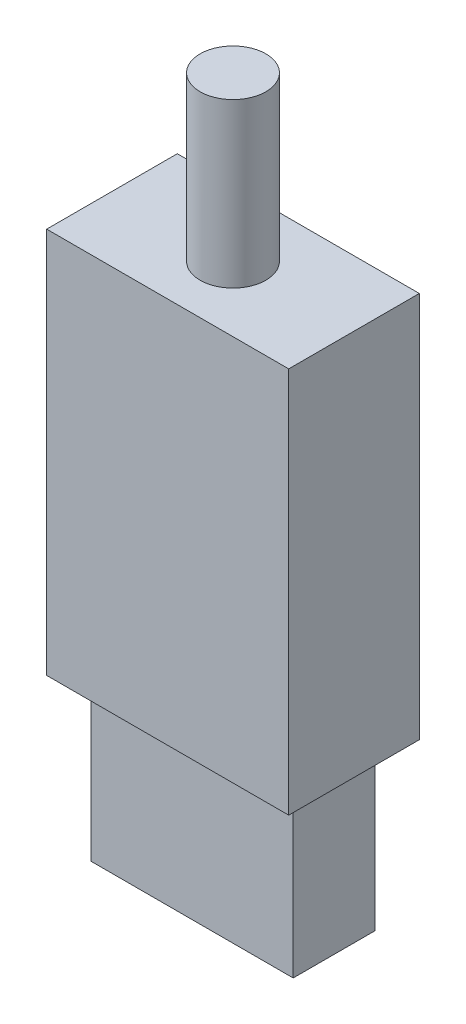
ISO-10303-21;
HEADER;
FILE_DESCRIPTION(('STEP AP214'),'2;1');
FILE_NAME('part.step','',(''),(''),'','','');
FILE_SCHEMA(('AUTOMOTIVE_DESIGN { 1 0 10303 214 1 1 1 1 }'));
ENDSEC;
DATA;
#1=APPLICATION_CONTEXT('core data for automotive mechanical design processes');
#2=APPLICATION_PROTOCOL_DEFINITION('international standard','automotive_design',2000,#1);
#3=PRODUCT_CONTEXT('',#1,'mechanical');
#4=PRODUCT('Part','Part','',(#3));
#5=PRODUCT_RELATED_PRODUCT_CATEGORY('part','',(#4));
#6=PRODUCT_DEFINITION_FORMATION('','',#4);
#7=PRODUCT_DEFINITION_CONTEXT('part definition',#1,'design');
#8=PRODUCT_DEFINITION('design','',#6,#7);
#9=PRODUCT_DEFINITION_SHAPE('','',#8);
#10=(LENGTH_UNIT() NAMED_UNIT(*) SI_UNIT(.MILLI.,.METRE.));
#11=(NAMED_UNIT(*) PLANE_ANGLE_UNIT() SI_UNIT($,.RADIAN.));
#12=(NAMED_UNIT(*) SI_UNIT($,.STERADIAN.) SOLID_ANGLE_UNIT());
#13=UNCERTAINTY_MEASURE_WITH_UNIT(LENGTH_MEASURE(1.E-05),#10,'distance_accuracy_value','');
#14=(GEOMETRIC_REPRESENTATION_CONTEXT(3) GLOBAL_UNCERTAINTY_ASSIGNED_CONTEXT((#13)) GLOBAL_UNIT_ASSIGNED_CONTEXT((#10,
#11,#12)) REPRESENTATION_CONTEXT('',''));
#15=CARTESIAN_POINT('',(0.,0.,0.));
#16=DIRECTION('',(0.,0.,1.));
#17=DIRECTION('',(1.,0.,0.));
#18=AXIS2_PLACEMENT_3D('',#15,#16,#17);
#19=CARTESIAN_POINT('',(0.,10.16,0.));
#20=DIRECTION('',(1.,0.,0.));
#21=DIRECTION('',(0.,0.,-1.));
#22=AXIS2_PLACEMENT_3D('',#19,#20,#21);
#23=PLANE('',#22);
#24=DIRECTION('',(0.,0.,1.));
#25=VECTOR('',#24,1.);
#26=CARTESIAN_POINT('',(0.,0.,0.));
#27=LINE('',#26,#25);
#28=CARTESIAN_POINT('',(0.,0.,-5.07999999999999));
#29=VERTEX_POINT('',#28);
#30=CARTESIAN_POINT('',(0.,0.,0.));
#31=VERTEX_POINT('',#30);
#32=EDGE_CURVE('E132',#29,#31,#27,.T.);
#33=ORIENTED_EDGE('',*,*,#32,.T.);
#34=DIRECTION('',(0.,-1.,0.));
#35=VECTOR('',#34,1.);
#36=CARTESIAN_POINT('',(0.,10.16,0.));
#37=LINE('',#36,#35);
#38=CARTESIAN_POINT('',(0.,10.16,0.));
#39=VERTEX_POINT('',#38);
#40=EDGE_CURVE('E41',#39,#31,#37,.T.);
#41=ORIENTED_EDGE('',*,*,#40,.F.);
#42=DIRECTION('',(0.,0.,1.));
#43=VECTOR('',#42,1.);
#44=CARTESIAN_POINT('',(0.,10.16,0.));
#45=LINE('',#44,#43);
#46=CARTESIAN_POINT('',(0.,10.16,-5.07999999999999));
#47=VERTEX_POINT('',#46);
#48=EDGE_CURVE('E141',#47,#39,#45,.T.);
#49=ORIENTED_EDGE('',*,*,#48,.F.);
#50=DIRECTION('',(0.,-1.,0.));
#51=VECTOR('',#50,1.);
#52=CARTESIAN_POINT('',(0.,10.16,-5.07999999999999));
#53=LINE('',#52,#51);
#54=EDGE_CURVE('E150',#47,#29,#53,.T.);
#55=ORIENTED_EDGE('',*,*,#54,.T.);
#56=EDGE_LOOP('',(#33,#41,#49,#55));
#57=FACE_BOUND('',#56,.T.);
#58=ADVANCED_FACE('F33',(#57),#23,.F.);
#59=CARTESIAN_POINT('',(0.,10.16,0.));
#60=DIRECTION('',(0.,0.,-1.));
#61=DIRECTION('',(-1.,0.,0.));
#62=AXIS2_PLACEMENT_3D('',#59,#60,#61);
#63=PLANE('',#62);
#64=DIRECTION('',(1.,0.,0.));
#65=VECTOR('',#64,1.);
#66=CARTESIAN_POINT('',(0.,0.,0.));
#67=LINE('',#66,#65);
#68=CARTESIAN_POINT('',(12.573,0.,0.));
#69=VERTEX_POINT('',#68);
#70=EDGE_CURVE('E135',#31,#69,#67,.T.);
#71=ORIENTED_EDGE('',*,*,#70,.T.);
#72=DIRECTION('',(0.,-1.,0.));
#73=VECTOR('',#72,1.);
#74=CARTESIAN_POINT('',(12.573,10.16,0.));
#75=LINE('',#74,#73);
#76=CARTESIAN_POINT('',(12.573,10.16,0.));
#77=VERTEX_POINT('',#76);
#78=EDGE_CURVE('E157',#77,#69,#75,.T.);
#79=ORIENTED_EDGE('',*,*,#78,.F.);
#80=DIRECTION('',(1.,0.,0.));
#81=VECTOR('',#80,1.);
#82=CARTESIAN_POINT('',(0.,10.16,0.));
#83=LINE('',#82,#81);
#84=EDGE_CURVE('E76',#39,#77,#83,.T.);
#85=ORIENTED_EDGE('',*,*,#84,.F.);
#86=ORIENTED_EDGE('',*,*,#40,.T.);
#87=EDGE_LOOP('',(#71,#79,#85,#86));
#88=FACE_BOUND('',#87,.T.);
#89=ADVANCED_FACE('F158',(#88),#63,.F.);
#90=CARTESIAN_POINT('',(12.573,10.16,0.));
#91=DIRECTION('',(-1.,0.,0.));
#92=DIRECTION('',(0.,0.,1.));
#93=AXIS2_PLACEMENT_3D('',#90,#91,#92);
#94=PLANE('',#93);
#95=DIRECTION('',(0.,0.,-1.));
#96=VECTOR('',#95,1.);
#97=CARTESIAN_POINT('',(12.573,0.,0.));
#98=LINE('',#97,#96);
#99=CARTESIAN_POINT('',(12.573,0.,-5.07999999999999));
#100=VERTEX_POINT('',#99);
#101=EDGE_CURVE('E65',#69,#100,#98,.T.);
#102=ORIENTED_EDGE('',*,*,#101,.T.);
#103=DIRECTION('',(0.,-1.,0.));
#104=VECTOR('',#103,1.);
#105=CARTESIAN_POINT('',(12.573,10.16,-5.07999999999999));
#106=LINE('',#105,#104);
#107=CARTESIAN_POINT('',(12.573,10.16,-5.07999999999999));
#108=VERTEX_POINT('',#107);
#109=EDGE_CURVE('E49',#108,#100,#106,.T.);
#110=ORIENTED_EDGE('',*,*,#109,.F.);
#111=DIRECTION('',(0.,0.,-1.));
#112=VECTOR('',#111,1.);
#113=CARTESIAN_POINT('',(12.573,10.16,0.));
#114=LINE('',#113,#112);
#115=EDGE_CURVE('E145',#77,#108,#114,.T.);
#116=ORIENTED_EDGE('',*,*,#115,.F.);
#117=ORIENTED_EDGE('',*,*,#78,.T.);
#118=EDGE_LOOP('',(#102,#110,#116,#117));
#119=FACE_BOUND('',#118,.T.);
#120=ADVANCED_FACE('F173',(#119),#94,.F.);
#121=CARTESIAN_POINT('',(0.,10.16,-5.07999999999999));
#122=DIRECTION('',(0.,0.,1.));
#123=DIRECTION('',(1.,0.,0.));
#124=AXIS2_PLACEMENT_3D('',#121,#122,#123);
#125=PLANE('',#124);
#126=DIRECTION('',(-1.,0.,0.));
#127=VECTOR('',#126,1.);
#128=CARTESIAN_POINT('',(0.,0.,-5.07999999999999));
#129=LINE('',#128,#127);
#130=EDGE_CURVE('E70',#100,#29,#129,.T.);
#131=ORIENTED_EDGE('',*,*,#130,.T.);
#132=ORIENTED_EDGE('',*,*,#54,.F.);
#133=DIRECTION('',(-1.,0.,0.));
#134=VECTOR('',#133,1.);
#135=CARTESIAN_POINT('',(0.,10.16,-5.07999999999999));
#136=LINE('',#135,#134);
#137=EDGE_CURVE('E148',#108,#47,#136,.T.);
#138=ORIENTED_EDGE('',*,*,#137,.F.);
#139=ORIENTED_EDGE('',*,*,#109,.T.);
#140=EDGE_LOOP('',(#131,#132,#138,#139));
#141=FACE_BOUND('',#140,.T.);
#142=ADVANCED_FACE('F165',(#141),#125,.F.);
#143=CARTESIAN_POINT('',(0.,0.,0.));
#144=DIRECTION('',(0.,-1.,0.));
#145=DIRECTION('',(0.,0.,-1.));
#146=AXIS2_PLACEMENT_3D('',#143,#144,#145);
#147=PLANE('',#146);
#148=ORIENTED_EDGE('',*,*,#32,.F.);
#149=ORIENTED_EDGE('',*,*,#130,.F.);
#150=ORIENTED_EDGE('',*,*,#101,.F.);
#151=ORIENTED_EDGE('',*,*,#70,.F.);
#152=EDGE_LOOP('',(#148,#149,#150,#151));
#153=FACE_BOUND('',#152,.T.);
#154=ADVANCED_FACE('F162',(#153),#147,.T.);
#155=CARTESIAN_POINT('',(0.,10.16,0.));
#156=DIRECTION('',(0.,-1.,0.));
#157=DIRECTION('',(0.,0.,-1.));
#158=AXIS2_PLACEMENT_3D('',#155,#156,#157);
#159=PLANE('',#158);
#160=DIRECTION('',(0.,0.,1.));
#161=VECTOR('',#160,1.);
#162=CARTESIAN_POINT('',(-1.2446,10.16,1.524));
#163=LINE('',#162,#161);
#164=CARTESIAN_POINT('',(-1.2446,10.16,-6.604));
#165=VERTEX_POINT('',#164);
#166=CARTESIAN_POINT('',(-1.2446,10.16,1.524));
#167=VERTEX_POINT('',#166);
#168=EDGE_CURVE('E131',#165,#167,#163,.T.);
#169=ORIENTED_EDGE('',*,*,#168,.F.);
#170=DIRECTION('',(-1.,0.,0.));
#171=VECTOR('',#170,1.);
#172=CARTESIAN_POINT('',(-1.2446,10.16,-6.604));
#173=LINE('',#172,#171);
#174=CARTESIAN_POINT('',(13.8176,10.16,-6.604));
#175=VERTEX_POINT('',#174);
#176=EDGE_CURVE('E127',#175,#165,#173,.T.);
#177=ORIENTED_EDGE('',*,*,#176,.F.);
#178=DIRECTION('',(0.,0.,-1.));
#179=VECTOR('',#178,1.);
#180=CARTESIAN_POINT('',(13.8176,10.16,1.524));
#181=LINE('',#180,#179);
#182=CARTESIAN_POINT('',(13.8176,10.16,1.524));
#183=VERTEX_POINT('',#182);
#184=EDGE_CURVE('E276',#183,#175,#181,.T.);
#185=ORIENTED_EDGE('',*,*,#184,.F.);
#186=DIRECTION('',(1.,0.,0.));
#187=VECTOR('',#186,1.);
#188=CARTESIAN_POINT('',(-1.2446,10.16,1.524));
#189=LINE('',#188,#187);
#190=EDGE_CURVE('E269',#167,#183,#189,.T.);
#191=ORIENTED_EDGE('',*,*,#190,.F.);
#192=EDGE_LOOP('',(#169,#177,#185,#191));
#193=FACE_BOUND('',#192,.T.);
#194=ORIENTED_EDGE('',*,*,#48,.T.);
#195=ORIENTED_EDGE('',*,*,#84,.T.);
#196=ORIENTED_EDGE('',*,*,#115,.T.);
#197=ORIENTED_EDGE('',*,*,#137,.T.);
#198=EDGE_LOOP('',(#194,#195,#196,#197));
#199=FACE_BOUND('',#198,.T.);
#200=ADVANCED_FACE('F164',(#193,#199),#159,.T.);
#201=CARTESIAN_POINT('',(-1.2446,34.2138,1.524));
#202=DIRECTION('',(1.,0.,0.));
#203=DIRECTION('',(0.,0.,-1.));
#204=AXIS2_PLACEMENT_3D('',#201,#202,#203);
#205=PLANE('',#204);
#206=ORIENTED_EDGE('',*,*,#168,.T.);
#207=DIRECTION('',(0.,-1.,0.));
#208=VECTOR('',#207,1.);
#209=CARTESIAN_POINT('',(-1.2446,34.2138,1.524));
#210=LINE('',#209,#208);
#211=CARTESIAN_POINT('',(-1.2446,34.2138,1.524));
#212=VERTEX_POINT('',#211);
#213=EDGE_CURVE('E111',#212,#167,#210,.T.);
#214=ORIENTED_EDGE('',*,*,#213,.F.);
#215=DIRECTION('',(0.,0.,1.));
#216=VECTOR('',#215,1.);
#217=CARTESIAN_POINT('',(-1.2446,34.2138,1.524));
#218=LINE('',#217,#216);
#219=CARTESIAN_POINT('',(-1.2446,34.2138,-6.604));
#220=VERTEX_POINT('',#219);
#221=EDGE_CURVE('E118',#220,#212,#218,.T.);
#222=ORIENTED_EDGE('',*,*,#221,.F.);
#223=DIRECTION('',(0.,-1.,0.));
#224=VECTOR('',#223,1.);
#225=CARTESIAN_POINT('',(-1.2446,34.2138,-6.604));
#226=LINE('',#225,#224);
#227=EDGE_CURVE('E273',#220,#165,#226,.T.);
#228=ORIENTED_EDGE('',*,*,#227,.T.);
#229=EDGE_LOOP('',(#206,#214,#222,#228));
#230=FACE_BOUND('',#229,.T.);
#231=ADVANCED_FACE('F129',(#230),#205,.F.);
#232=CARTESIAN_POINT('',(-1.2446,34.2138,1.524));
#233=DIRECTION('',(0.,0.,-1.));
#234=DIRECTION('',(-1.,0.,0.));
#235=AXIS2_PLACEMENT_3D('',#232,#233,#234);
#236=PLANE('',#235);
#237=ORIENTED_EDGE('',*,*,#190,.T.);
#238=DIRECTION('',(0.,-1.,0.));
#239=VECTOR('',#238,1.);
#240=CARTESIAN_POINT('',(13.8176,34.2138,1.524));
#241=LINE('',#240,#239);
#242=CARTESIAN_POINT('',(13.8176,34.2138,1.524));
#243=VERTEX_POINT('',#242);
#244=EDGE_CURVE('E114',#243,#183,#241,.T.);
#245=ORIENTED_EDGE('',*,*,#244,.F.);
#246=DIRECTION('',(1.,0.,0.));
#247=VECTOR('',#246,1.);
#248=CARTESIAN_POINT('',(-1.2446,34.2138,1.524));
#249=LINE('',#248,#247);
#250=EDGE_CURVE('E107',#212,#243,#249,.T.);
#251=ORIENTED_EDGE('',*,*,#250,.F.);
#252=ORIENTED_EDGE('',*,*,#213,.T.);
#253=EDGE_LOOP('',(#237,#245,#251,#252));
#254=FACE_BOUND('',#253,.T.);
#255=ADVANCED_FACE('F109',(#254),#236,.F.);
#256=CARTESIAN_POINT('',(13.8176,34.2138,1.524));
#257=DIRECTION('',(-1.,0.,0.));
#258=DIRECTION('',(0.,0.,1.));
#259=AXIS2_PLACEMENT_3D('',#256,#257,#258);
#260=PLANE('',#259);
#261=ORIENTED_EDGE('',*,*,#184,.T.);
#262=DIRECTION('',(0.,-1.,0.));
#263=VECTOR('',#262,1.);
#264=CARTESIAN_POINT('',(13.8176,34.2138,-6.604));
#265=LINE('',#264,#263);
#266=CARTESIAN_POINT('',(13.8176,34.2138,-6.604));
#267=VERTEX_POINT('',#266);
#268=EDGE_CURVE('E137',#267,#175,#265,.T.);
#269=ORIENTED_EDGE('',*,*,#268,.F.);
#270=DIRECTION('',(0.,0.,-1.));
#271=VECTOR('',#270,1.);
#272=CARTESIAN_POINT('',(13.8176,34.2138,1.524));
#273=LINE('',#272,#271);
#274=EDGE_CURVE('E117',#243,#267,#273,.T.);
#275=ORIENTED_EDGE('',*,*,#274,.F.);
#276=ORIENTED_EDGE('',*,*,#244,.T.);
#277=EDGE_LOOP('',(#261,#269,#275,#276));
#278=FACE_BOUND('',#277,.T.);
#279=ADVANCED_FACE('F213',(#278),#260,.F.);
#280=CARTESIAN_POINT('',(-1.2446,34.2138,-6.604));
#281=DIRECTION('',(0.,0.,1.));
#282=DIRECTION('',(1.,0.,0.));
#283=AXIS2_PLACEMENT_3D('',#280,#281,#282);
#284=PLANE('',#283);
#285=ORIENTED_EDGE('',*,*,#176,.T.);
#286=ORIENTED_EDGE('',*,*,#227,.F.);
#287=DIRECTION('',(-1.,0.,0.));
#288=VECTOR('',#287,1.);
#289=CARTESIAN_POINT('',(-1.2446,34.2138,-6.604));
#290=LINE('',#289,#288);
#291=EDGE_CURVE('E123',#267,#220,#290,.T.);
#292=ORIENTED_EDGE('',*,*,#291,.F.);
#293=ORIENTED_EDGE('',*,*,#268,.T.);
#294=EDGE_LOOP('',(#285,#286,#292,#293));
#295=FACE_BOUND('',#294,.T.);
#296=ADVANCED_FACE('F222',(#295),#284,.F.);
#297=CARTESIAN_POINT('',(0.,34.2138,0.));
#298=DIRECTION('',(0.,-1.,0.));
#299=DIRECTION('',(0.,0.,-1.));
#300=AXIS2_PLACEMENT_3D('',#297,#298,#299);
#301=PLANE('',#300);
#302=CARTESIAN_POINT('',(6.2865,34.2138,-2.54));
#303=DIRECTION('',(0.,-1.,0.));
#304=DIRECTION('',(0.,0.,-1.));
#305=AXIS2_PLACEMENT_3D('',#302,#303,#304);
#306=CIRCLE('',#305,2.0447);
#307=CARTESIAN_POINT('',(6.2865,34.2138,-4.5847));
#308=VERTEX_POINT('',#307);
#309=EDGE_CURVE('E11',#308,#308,#306,.F.);
#310=ORIENTED_EDGE('',*,*,#309,.F.);
#311=EDGE_LOOP('',(#310));
#312=FACE_BOUND('',#311,.T.);
#313=ORIENTED_EDGE('',*,*,#221,.T.);
#314=ORIENTED_EDGE('',*,*,#250,.T.);
#315=ORIENTED_EDGE('',*,*,#274,.T.);
#316=ORIENTED_EDGE('',*,*,#291,.T.);
#317=EDGE_LOOP('',(#313,#314,#315,#316));
#318=FACE_BOUND('',#317,.T.);
#319=ADVANCED_FACE('F121',(#312,#318),#301,.F.);
#320=CARTESIAN_POINT('',(6.2865,44.3738,-2.54));
#321=DIRECTION('',(0.,-1.,0.));
#322=DIRECTION('',(0.,0.,-1.));
#323=AXIS2_PLACEMENT_3D('',#320,#321,#322);
#324=CYLINDRICAL_SURFACE('',#323,2.0447);
#325=CARTESIAN_POINT('',(6.2865,44.3738,-2.54));
#326=DIRECTION('',(0.,1.,0.));
#327=DIRECTION('',(0.,0.,1.));
#328=AXIS2_PLACEMENT_3D('',#325,#326,#327);
#329=CIRCLE('',#328,2.0447);
#330=CARTESIAN_POINT('',(6.2865,44.3738,-0.495299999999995));
#331=VERTEX_POINT('',#330);
#332=EDGE_CURVE('E267',#331,#331,#329,.T.);
#333=ORIENTED_EDGE('',*,*,#332,.F.);
#334=EDGE_LOOP('',(#333));
#335=FACE_BOUND('',#334,.T.);
#336=ORIENTED_EDGE('',*,*,#309,.T.);
#337=EDGE_LOOP('',(#336));
#338=FACE_BOUND('',#337,.T.);
#339=ADVANCED_FACE('F241',(#335,#338),#324,.T.);
#340=CARTESIAN_POINT('',(6.2865,44.3738,-2.54));
#341=DIRECTION('',(0.,1.,0.));
#342=DIRECTION('',(0.,0.,1.));
#343=AXIS2_PLACEMENT_3D('',#340,#341,#342);
#344=PLANE('',#343);
#345=ORIENTED_EDGE('',*,*,#332,.T.);
#346=EDGE_LOOP('',(#345));
#347=FACE_BOUND('',#346,.T.);
#348=ADVANCED_FACE('F251',(#347),#344,.T.);
#349=CLOSED_SHELL('',(#58,#89,#120,#142,#154,#200,#231,#255,#279,#296,#319,#339,#348));
#350=MANIFOLD_SOLID_BREP('B2',#349);
#351=ADVANCED_BREP_SHAPE_REPRESENTATION('',(#18,#350),#14);
#352=SHAPE_DEFINITION_REPRESENTATION(#9,#351);
ENDSEC;
END-ISO-10303-21;
